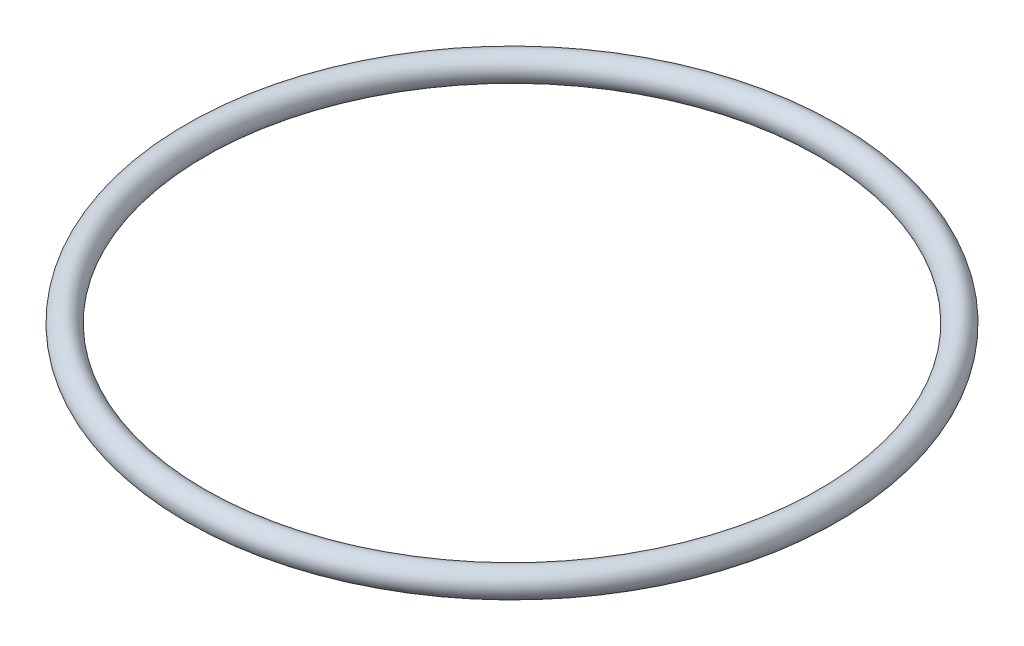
ISO-10303-21;
HEADER;
FILE_DESCRIPTION(('STEP AP214'),'2;1');
FILE_NAME('part.step','',(''),(''),'','','');
FILE_SCHEMA(('AUTOMOTIVE_DESIGN { 1 0 10303 214 1 1 1 1 }'));
ENDSEC;
DATA;
#1=APPLICATION_CONTEXT('core data for automotive mechanical design processes');
#2=APPLICATION_PROTOCOL_DEFINITION('international standard','automotive_design',2000,#1);
#3=PRODUCT_CONTEXT('',#1,'mechanical');
#4=PRODUCT('Part','Part','',(#3));
#5=PRODUCT_RELATED_PRODUCT_CATEGORY('part','',(#4));
#6=PRODUCT_DEFINITION_FORMATION('','',#4);
#7=PRODUCT_DEFINITION_CONTEXT('part definition',#1,'design');
#8=PRODUCT_DEFINITION('design','',#6,#7);
#9=PRODUCT_DEFINITION_SHAPE('','',#8);
#10=(LENGTH_UNIT() NAMED_UNIT(*) SI_UNIT(.MILLI.,.METRE.));
#11=(NAMED_UNIT(*) PLANE_ANGLE_UNIT() SI_UNIT($,.RADIAN.));
#12=(NAMED_UNIT(*) SI_UNIT($,.STERADIAN.) SOLID_ANGLE_UNIT());
#13=UNCERTAINTY_MEASURE_WITH_UNIT(LENGTH_MEASURE(1.E-05),#10,'distance_accuracy_value','');
#14=(GEOMETRIC_REPRESENTATION_CONTEXT(3) GLOBAL_UNCERTAINTY_ASSIGNED_CONTEXT((#13)) GLOBAL_UNIT_ASSIGNED_CONTEXT((#10,
#11,#12)) REPRESENTATION_CONTEXT('',''));
#15=CARTESIAN_POINT('',(0.,0.,0.));
#16=DIRECTION('',(0.,0.,1.));
#17=DIRECTION('',(1.,0.,0.));
#18=AXIS2_PLACEMENT_3D('',#15,#16,#17);
#19=CARTESIAN_POINT('',(0.,0.,0.));
#20=DIRECTION('',(0.,-1.,0.));
#21=DIRECTION('',(0.,0.,-1.));
#22=AXIS2_PLACEMENT_3D('',#19,#20,#21);
#23=TOROIDAL_SURFACE('',#22,12.,0.499999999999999);
#24=CARTESIAN_POINT('',(0.,0.,-12.5));
#25=VERTEX_POINT('',#24);
#26=VERTEX_LOOP('',#25);
#27=FACE_BOUND('',#26,.T.);
#28=ADVANCED_FACE('F29',(#27),#23,.T.);
#29=CLOSED_SHELL('',(#28));
#30=MANIFOLD_SOLID_BREP('B2',#29);
#31=ADVANCED_BREP_SHAPE_REPRESENTATION('',(#18,#30),#14);
#32=SHAPE_DEFINITION_REPRESENTATION(#9,#31);
ENDSEC;
END-ISO-10303-21;
